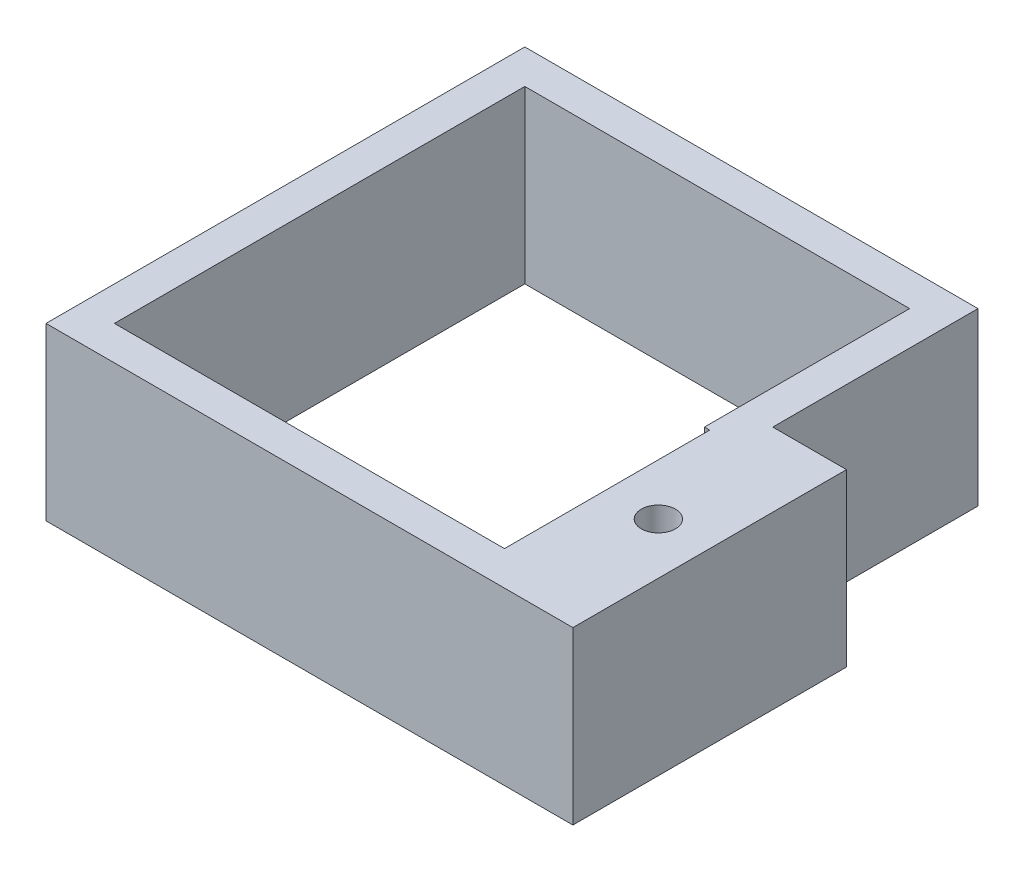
ISO-10303-21;
HEADER;
FILE_DESCRIPTION(('STEP AP214'),'2;1');
FILE_NAME('part.step','',(''),(''),'','','');
FILE_SCHEMA(('AUTOMOTIVE_DESIGN { 1 0 10303 214 1 1 1 1 }'));
ENDSEC;
DATA;
#1=APPLICATION_CONTEXT('core data for automotive mechanical design processes');
#2=APPLICATION_PROTOCOL_DEFINITION('international standard','automotive_design',2000,#1);
#3=PRODUCT_CONTEXT('',#1,'mechanical');
#4=PRODUCT('Part','Part','',(#3));
#5=PRODUCT_RELATED_PRODUCT_CATEGORY('part','',(#4));
#6=PRODUCT_DEFINITION_FORMATION('','',#4);
#7=PRODUCT_DEFINITION_CONTEXT('part definition',#1,'design');
#8=PRODUCT_DEFINITION('design','',#6,#7);
#9=PRODUCT_DEFINITION_SHAPE('','',#8);
#10=(LENGTH_UNIT() NAMED_UNIT(*) SI_UNIT(.MILLI.,.METRE.));
#11=(NAMED_UNIT(*) PLANE_ANGLE_UNIT() SI_UNIT($,.RADIAN.));
#12=(NAMED_UNIT(*) SI_UNIT($,.STERADIAN.) SOLID_ANGLE_UNIT());
#13=UNCERTAINTY_MEASURE_WITH_UNIT(LENGTH_MEASURE(1.E-05),#10,'distance_accuracy_value','');
#14=(GEOMETRIC_REPRESENTATION_CONTEXT(3) GLOBAL_UNCERTAINTY_ASSIGNED_CONTEXT((#13)) GLOBAL_UNIT_ASSIGNED_CONTEXT((#10,
#11,#12)) REPRESENTATION_CONTEXT('',''));
#15=CARTESIAN_POINT('',(0.,0.,0.));
#16=DIRECTION('',(0.,0.,1.));
#17=DIRECTION('',(1.,0.,0.));
#18=AXIS2_PLACEMENT_3D('',#15,#16,#17);
#19=CARTESIAN_POINT('',(0.,10.,0.));
#20=DIRECTION('',(0.,-1.,0.));
#21=DIRECTION('',(0.,0.,-1.));
#22=AXIS2_PLACEMENT_3D('',#19,#20,#21);
#23=PLANE('',#22);
#24=CARTESIAN_POINT('',(27.81,10.,-8.));
#25=DIRECTION('',(0.,1.,0.));
#26=DIRECTION('',(0.,0.,1.));
#27=AXIS2_PLACEMENT_3D('',#24,#25,#26);
#28=CIRCLE('',#27,1.);
#29=CARTESIAN_POINT('',(27.81,10.,-7.));
#30=VERTEX_POINT('',#29);
#31=EDGE_CURVE('E287',#30,#30,#28,.T.);
#32=ORIENTED_EDGE('',*,*,#31,.F.);
#33=EDGE_LOOP('',(#32));
#34=FACE_BOUND('',#33,.T.);
#35=DIRECTION('',(1.,0.,0.));
#36=VECTOR('',#35,1.);
#37=CARTESIAN_POINT('',(30.81,10.,0.));
#38=LINE('',#37,#36);
#39=CARTESIAN_POINT('',(0.,10.,0.));
#40=VERTEX_POINT('',#39);
#41=CARTESIAN_POINT('',(30.81,10.,0.));
#42=VERTEX_POINT('',#41);
#43=EDGE_CURVE('E175',#40,#42,#38,.T.);
#44=ORIENTED_EDGE('',*,*,#43,.T.);
#45=DIRECTION('',(0.,0.,-1.));
#46=VECTOR('',#45,1.);
#47=CARTESIAN_POINT('',(30.81,10.,-16.));
#48=LINE('',#47,#46);
#49=CARTESIAN_POINT('',(30.81,10.,-16.));
#50=VERTEX_POINT('',#49);
#51=EDGE_CURVE('E178',#42,#50,#48,.T.);
#52=ORIENTED_EDGE('',*,*,#51,.T.);
#53=DIRECTION('',(-1.,0.,0.));
#54=VECTOR('',#53,1.);
#55=CARTESIAN_POINT('',(26.5,10.,-16.));
#56=LINE('',#55,#54);
#57=CARTESIAN_POINT('',(26.5,10.,-16.));
#58=VERTEX_POINT('',#57);
#59=EDGE_CURVE('E181',#50,#58,#56,.T.);
#60=ORIENTED_EDGE('',*,*,#59,.T.);
#61=DIRECTION('',(0.,0.,-1.));
#62=VECTOR('',#61,1.);
#63=CARTESIAN_POINT('',(26.5,10.,-28.));
#64=LINE('',#63,#62);
#65=CARTESIAN_POINT('',(26.5,10.,-28.));
#66=VERTEX_POINT('',#65);
#67=EDGE_CURVE('E183',#58,#66,#64,.T.);
#68=ORIENTED_EDGE('',*,*,#67,.T.);
#69=DIRECTION('',(-1.,0.,0.));
#70=VECTOR('',#69,1.);
#71=CARTESIAN_POINT('',(0.,10.,-28.));
#72=LINE('',#71,#70);
#73=CARTESIAN_POINT('',(0.,10.,-28.));
#74=VERTEX_POINT('',#73);
#75=EDGE_CURVE('E185',#66,#74,#72,.T.);
#76=ORIENTED_EDGE('',*,*,#75,.T.);
#77=DIRECTION('',(0.,0.,1.));
#78=VECTOR('',#77,1.);
#79=CARTESIAN_POINT('',(0.,10.,0.));
#80=LINE('',#79,#78);
#81=EDGE_CURVE('E187',#74,#40,#80,.T.);
#82=ORIENTED_EDGE('',*,*,#81,.T.);
#83=EDGE_LOOP('',(#44,#52,#60,#68,#76,#82));
#84=FACE_BOUND('',#83,.T.);
#85=DIRECTION('',(0.,0.,-1.));
#86=VECTOR('',#85,1.);
#87=CARTESIAN_POINT('',(24.81,10.,-2.));
#88=LINE('',#87,#86);
#89=CARTESIAN_POINT('',(24.81,10.,-2.));
#90=VERTEX_POINT('',#89);
#91=CARTESIAN_POINT('',(24.81,10.,-14.));
#92=VERTEX_POINT('',#91);
#93=EDGE_CURVE('E120',#90,#92,#88,.T.);
#94=ORIENTED_EDGE('',*,*,#93,.F.);
#95=DIRECTION('',(1.,0.,0.));
#96=VECTOR('',#95,1.);
#97=CARTESIAN_POINT('',(2.00000000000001,10.,-1.99999999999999));
#98=LINE('',#97,#96);
#99=CARTESIAN_POINT('',(2.00000000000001,10.,-1.99999999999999));
#100=VERTEX_POINT('',#99);
#101=EDGE_CURVE('E151',#100,#90,#98,.T.);
#102=ORIENTED_EDGE('',*,*,#101,.F.);
#103=DIRECTION('',(0.,0.,1.));
#104=VECTOR('',#103,1.);
#105=CARTESIAN_POINT('',(2.,10.,-26.));
#106=LINE('',#105,#104);
#107=CARTESIAN_POINT('',(2.,10.,-26.));
#108=VERTEX_POINT('',#107);
#109=EDGE_CURVE('E149',#108,#100,#106,.T.);
#110=ORIENTED_EDGE('',*,*,#109,.F.);
#111=DIRECTION('',(-1.,0.,0.));
#112=VECTOR('',#111,1.);
#113=CARTESIAN_POINT('',(24.5,10.,-26.));
#114=LINE('',#113,#112);
#115=CARTESIAN_POINT('',(24.5,10.,-26.));
#116=VERTEX_POINT('',#115);
#117=EDGE_CURVE('E144',#116,#108,#114,.T.);
#118=ORIENTED_EDGE('',*,*,#117,.F.);
#119=DIRECTION('',(0.,0.,-1.));
#120=VECTOR('',#119,1.);
#121=CARTESIAN_POINT('',(24.5,10.,-14.));
#122=LINE('',#121,#120);
#123=CARTESIAN_POINT('',(24.5,10.,-14.));
#124=VERTEX_POINT('',#123);
#125=EDGE_CURVE('E142',#124,#116,#122,.T.);
#126=ORIENTED_EDGE('',*,*,#125,.F.);
#127=DIRECTION('',(-1.,0.,0.));
#128=VECTOR('',#127,1.);
#129=CARTESIAN_POINT('',(24.81,10.,-14.));
#130=LINE('',#129,#128);
#131=EDGE_CURVE('E128',#92,#124,#130,.T.);
#132=ORIENTED_EDGE('',*,*,#131,.F.);
#133=EDGE_LOOP('',(#94,#102,#110,#118,#126,#132));
#134=FACE_BOUND('',#133,.T.);
#135=ADVANCED_FACE('F33',(#34,#84,#134),#23,.F.);
#136=CARTESIAN_POINT('',(0.,0.,0.));
#137=DIRECTION('',(0.,-1.,0.));
#138=DIRECTION('',(0.,0.,-1.));
#139=AXIS2_PLACEMENT_3D('',#136,#137,#138);
#140=PLANE('',#139);
#141=CARTESIAN_POINT('',(27.81,0.,-8.));
#142=DIRECTION('',(0.,1.,0.));
#143=DIRECTION('',(0.,0.,1.));
#144=AXIS2_PLACEMENT_3D('',#141,#142,#143);
#145=CIRCLE('',#144,1.);
#146=CARTESIAN_POINT('',(27.81,0.,-7.));
#147=VERTEX_POINT('',#146);
#148=EDGE_CURVE('E155',#147,#147,#145,.T.);
#149=ORIENTED_EDGE('',*,*,#148,.T.);
#150=EDGE_LOOP('',(#149));
#151=FACE_BOUND('',#150,.T.);
#152=DIRECTION('',(1.,0.,0.));
#153=VECTOR('',#152,1.);
#154=CARTESIAN_POINT('',(30.81,0.,0.));
#155=LINE('',#154,#153);
#156=CARTESIAN_POINT('',(0.,0.,0.));
#157=VERTEX_POINT('',#156);
#158=CARTESIAN_POINT('',(30.81,0.,0.));
#159=VERTEX_POINT('',#158);
#160=EDGE_CURVE('E137',#157,#159,#155,.T.);
#161=ORIENTED_EDGE('',*,*,#160,.F.);
#162=DIRECTION('',(0.,0.,1.));
#163=VECTOR('',#162,1.);
#164=CARTESIAN_POINT('',(0.,0.,0.));
#165=LINE('',#164,#163);
#166=CARTESIAN_POINT('',(0.,0.,-28.));
#167=VERTEX_POINT('',#166);
#168=EDGE_CURVE('E179',#167,#157,#165,.T.);
#169=ORIENTED_EDGE('',*,*,#168,.F.);
#170=DIRECTION('',(-1.,0.,0.));
#171=VECTOR('',#170,1.);
#172=CARTESIAN_POINT('',(0.,0.,-28.));
#173=LINE('',#172,#171);
#174=CARTESIAN_POINT('',(26.5,0.,-28.));
#175=VERTEX_POINT('',#174);
#176=EDGE_CURVE('E198',#175,#167,#173,.T.);
#177=ORIENTED_EDGE('',*,*,#176,.F.);
#178=DIRECTION('',(0.,0.,-1.));
#179=VECTOR('',#178,1.);
#180=CARTESIAN_POINT('',(26.5,0.,-28.));
#181=LINE('',#180,#179);
#182=CARTESIAN_POINT('',(26.5,0.,-16.));
#183=VERTEX_POINT('',#182);
#184=EDGE_CURVE('E196',#183,#175,#181,.T.);
#185=ORIENTED_EDGE('',*,*,#184,.F.);
#186=DIRECTION('',(-1.,0.,0.));
#187=VECTOR('',#186,1.);
#188=CARTESIAN_POINT('',(26.5,0.,-16.));
#189=LINE('',#188,#187);
#190=CARTESIAN_POINT('',(30.81,0.,-16.));
#191=VERTEX_POINT('',#190);
#192=EDGE_CURVE('E194',#191,#183,#189,.T.);
#193=ORIENTED_EDGE('',*,*,#192,.F.);
#194=DIRECTION('',(0.,0.,-1.));
#195=VECTOR('',#194,1.);
#196=CARTESIAN_POINT('',(30.81,0.,-16.));
#197=LINE('',#196,#195);
#198=EDGE_CURVE('E192',#159,#191,#197,.T.);
#199=ORIENTED_EDGE('',*,*,#198,.F.);
#200=EDGE_LOOP('',(#161,#169,#177,#185,#193,#199));
#201=FACE_BOUND('',#200,.T.);
#202=DIRECTION('',(1.,0.,0.));
#203=VECTOR('',#202,1.);
#204=CARTESIAN_POINT('',(2.00000000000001,0.,-1.99999999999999));
#205=LINE('',#204,#203);
#206=CARTESIAN_POINT('',(2.00000000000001,0.,-1.99999999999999));
#207=VERTEX_POINT('',#206);
#208=CARTESIAN_POINT('',(24.81,0.,-2.));
#209=VERTEX_POINT('',#208);
#210=EDGE_CURVE('E129',#207,#209,#205,.T.);
#211=ORIENTED_EDGE('',*,*,#210,.T.);
#212=DIRECTION('',(0.,0.,-1.));
#213=VECTOR('',#212,1.);
#214=CARTESIAN_POINT('',(24.81,0.,-6.73909948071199));
#215=LINE('',#214,#213);
#216=CARTESIAN_POINT('',(24.81,0.,-14.));
#217=VERTEX_POINT('',#216);
#218=EDGE_CURVE('E153',#209,#217,#215,.T.);
#219=ORIENTED_EDGE('',*,*,#218,.T.);
#220=DIRECTION('',(-1.,0.,0.));
#221=VECTOR('',#220,1.);
#222=CARTESIAN_POINT('',(24.81,0.,-14.));
#223=LINE('',#222,#221);
#224=CARTESIAN_POINT('',(24.5,0.,-14.));
#225=VERTEX_POINT('',#224);
#226=EDGE_CURVE('E135',#217,#225,#223,.T.);
#227=ORIENTED_EDGE('',*,*,#226,.T.);
#228=DIRECTION('',(0.,0.,-1.));
#229=VECTOR('',#228,1.);
#230=CARTESIAN_POINT('',(24.5,0.,-14.));
#231=LINE('',#230,#229);
#232=CARTESIAN_POINT('',(24.5,0.,-26.));
#233=VERTEX_POINT('',#232);
#234=EDGE_CURVE('E157',#225,#233,#231,.T.);
#235=ORIENTED_EDGE('',*,*,#234,.T.);
#236=DIRECTION('',(-1.,0.,0.));
#237=VECTOR('',#236,1.);
#238=CARTESIAN_POINT('',(24.5,0.,-26.));
#239=LINE('',#238,#237);
#240=CARTESIAN_POINT('',(2.,0.,-26.));
#241=VERTEX_POINT('',#240);
#242=EDGE_CURVE('E160',#233,#241,#239,.T.);
#243=ORIENTED_EDGE('',*,*,#242,.T.);
#244=DIRECTION('',(0.,0.,1.));
#245=VECTOR('',#244,1.);
#246=CARTESIAN_POINT('',(2.,0.,-26.));
#247=LINE('',#246,#245);
#248=EDGE_CURVE('E163',#241,#207,#247,.T.);
#249=ORIENTED_EDGE('',*,*,#248,.T.);
#250=EDGE_LOOP('',(#211,#219,#227,#235,#243,#249));
#251=FACE_BOUND('',#250,.T.);
#252=ADVANCED_FACE('F222',(#151,#201,#251),#140,.T.);
#253=CARTESIAN_POINT('',(30.81,10.,0.));
#254=DIRECTION('',(0.,0.,-1.));
#255=DIRECTION('',(-1.,0.,0.));
#256=AXIS2_PLACEMENT_3D('',#253,#254,#255);
#257=PLANE('',#256);
#258=ORIENTED_EDGE('',*,*,#160,.T.);
#259=DIRECTION('',(0.,-1.,0.));
#260=VECTOR('',#259,1.);
#261=CARTESIAN_POINT('',(30.81,10.,0.));
#262=LINE('',#261,#260);
#263=EDGE_CURVE('E11',#42,#159,#262,.T.);
#264=ORIENTED_EDGE('',*,*,#263,.F.);
#265=ORIENTED_EDGE('',*,*,#43,.F.);
#266=DIRECTION('',(0.,-1.,0.));
#267=VECTOR('',#266,1.);
#268=CARTESIAN_POINT('',(0.,10.,0.));
#269=LINE('',#268,#267);
#270=EDGE_CURVE('E189',#40,#157,#269,.T.);
#271=ORIENTED_EDGE('',*,*,#270,.T.);
#272=EDGE_LOOP('',(#258,#264,#265,#271));
#273=FACE_BOUND('',#272,.T.);
#274=ADVANCED_FACE('F35',(#273),#257,.F.);
#275=CARTESIAN_POINT('',(30.81,10.,-16.));
#276=DIRECTION('',(-1.,0.,0.));
#277=DIRECTION('',(0.,0.,1.));
#278=AXIS2_PLACEMENT_3D('',#275,#276,#277);
#279=PLANE('',#278);
#280=ORIENTED_EDGE('',*,*,#198,.T.);
#281=DIRECTION('',(0.,-1.,0.));
#282=VECTOR('',#281,1.);
#283=CARTESIAN_POINT('',(30.81,10.,-16.));
#284=LINE('',#283,#282);
#285=EDGE_CURVE('E41',#50,#191,#284,.T.);
#286=ORIENTED_EDGE('',*,*,#285,.F.);
#287=ORIENTED_EDGE('',*,*,#51,.F.);
#288=ORIENTED_EDGE('',*,*,#263,.T.);
#289=EDGE_LOOP('',(#280,#286,#287,#288));
#290=FACE_BOUND('',#289,.T.);
#291=ADVANCED_FACE('F239',(#290),#279,.F.);
#292=CARTESIAN_POINT('',(26.5,10.,-16.));
#293=DIRECTION('',(0.,0.,1.));
#294=DIRECTION('',(1.,0.,0.));
#295=AXIS2_PLACEMENT_3D('',#292,#293,#294);
#296=PLANE('',#295);
#297=ORIENTED_EDGE('',*,*,#192,.T.);
#298=DIRECTION('',(0.,-1.,0.));
#299=VECTOR('',#298,1.);
#300=CARTESIAN_POINT('',(26.5,10.,-16.));
#301=LINE('',#300,#299);
#302=EDGE_CURVE('E209',#58,#183,#301,.T.);
#303=ORIENTED_EDGE('',*,*,#302,.F.);
#304=ORIENTED_EDGE('',*,*,#59,.F.);
#305=ORIENTED_EDGE('',*,*,#285,.T.);
#306=EDGE_LOOP('',(#297,#303,#304,#305));
#307=FACE_BOUND('',#306,.T.);
#308=ADVANCED_FACE('F216',(#307),#296,.F.);
#309=CARTESIAN_POINT('',(26.5,10.,-28.));
#310=DIRECTION('',(-1.,0.,0.));
#311=DIRECTION('',(0.,0.,1.));
#312=AXIS2_PLACEMENT_3D('',#309,#310,#311);
#313=PLANE('',#312);
#314=ORIENTED_EDGE('',*,*,#184,.T.);
#315=DIRECTION('',(0.,-1.,0.));
#316=VECTOR('',#315,1.);
#317=CARTESIAN_POINT('',(26.5,10.,-28.));
#318=LINE('',#317,#316);
#319=EDGE_CURVE('E206',#66,#175,#318,.T.);
#320=ORIENTED_EDGE('',*,*,#319,.F.);
#321=ORIENTED_EDGE('',*,*,#67,.F.);
#322=ORIENTED_EDGE('',*,*,#302,.T.);
#323=EDGE_LOOP('',(#314,#320,#321,#322));
#324=FACE_BOUND('',#323,.T.);
#325=ADVANCED_FACE('F228',(#324),#313,.F.);
#326=CARTESIAN_POINT('',(0.,10.,-28.));
#327=DIRECTION('',(0.,0.,1.));
#328=DIRECTION('',(1.,0.,0.));
#329=AXIS2_PLACEMENT_3D('',#326,#327,#328);
#330=PLANE('',#329);
#331=ORIENTED_EDGE('',*,*,#176,.T.);
#332=DIRECTION('',(0.,-1.,0.));
#333=VECTOR('',#332,1.);
#334=CARTESIAN_POINT('',(0.,10.,-28.));
#335=LINE('',#334,#333);
#336=EDGE_CURVE('E203',#74,#167,#335,.T.);
#337=ORIENTED_EDGE('',*,*,#336,.F.);
#338=ORIENTED_EDGE('',*,*,#75,.F.);
#339=ORIENTED_EDGE('',*,*,#319,.T.);
#340=EDGE_LOOP('',(#331,#337,#338,#339));
#341=FACE_BOUND('',#340,.T.);
#342=ADVANCED_FACE('F232',(#341),#330,.F.);
#343=CARTESIAN_POINT('',(0.,10.,0.));
#344=DIRECTION('',(1.,0.,0.));
#345=DIRECTION('',(0.,0.,-1.));
#346=AXIS2_PLACEMENT_3D('',#343,#344,#345);
#347=PLANE('',#346);
#348=ORIENTED_EDGE('',*,*,#168,.T.);
#349=ORIENTED_EDGE('',*,*,#270,.F.);
#350=ORIENTED_EDGE('',*,*,#81,.F.);
#351=ORIENTED_EDGE('',*,*,#336,.T.);
#352=EDGE_LOOP('',(#348,#349,#350,#351));
#353=FACE_BOUND('',#352,.T.);
#354=ADVANCED_FACE('F242',(#353),#347,.F.);
#355=CARTESIAN_POINT('',(24.81,10.,-6.73909948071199));
#356=DIRECTION('',(-1.,0.,0.));
#357=DIRECTION('',(0.,0.,1.));
#358=AXIS2_PLACEMENT_3D('',#355,#356,#357);
#359=PLANE('',#358);
#360=ORIENTED_EDGE('',*,*,#218,.F.);
#361=DIRECTION('',(0.,-1.,0.));
#362=VECTOR('',#361,1.);
#363=CARTESIAN_POINT('',(24.81,10.,-2.));
#364=LINE('',#363,#362);
#365=EDGE_CURVE('E53',#90,#209,#364,.T.);
#366=ORIENTED_EDGE('',*,*,#365,.F.);
#367=ORIENTED_EDGE('',*,*,#93,.T.);
#368=DIRECTION('',(0.,-1.,0.));
#369=VECTOR('',#368,1.);
#370=CARTESIAN_POINT('',(24.81,10.,-14.));
#371=LINE('',#370,#369);
#372=EDGE_CURVE('E123',#92,#217,#371,.T.);
#373=ORIENTED_EDGE('',*,*,#372,.T.);
#374=EDGE_LOOP('',(#360,#366,#367,#373));
#375=FACE_BOUND('',#374,.T.);
#376=ADVANCED_FACE('F122',(#375),#359,.T.);
#377=CARTESIAN_POINT('',(24.81,10.,-14.));
#378=DIRECTION('',(0.,0.,1.));
#379=DIRECTION('',(1.,0.,0.));
#380=AXIS2_PLACEMENT_3D('',#377,#378,#379);
#381=PLANE('',#380);
#382=ORIENTED_EDGE('',*,*,#226,.F.);
#383=ORIENTED_EDGE('',*,*,#372,.F.);
#384=ORIENTED_EDGE('',*,*,#131,.T.);
#385=DIRECTION('',(0.,-1.,0.));
#386=VECTOR('',#385,1.);
#387=CARTESIAN_POINT('',(24.5,10.,-14.));
#388=LINE('',#387,#386);
#389=EDGE_CURVE('E138',#124,#225,#388,.T.);
#390=ORIENTED_EDGE('',*,*,#389,.T.);
#391=EDGE_LOOP('',(#382,#383,#384,#390));
#392=FACE_BOUND('',#391,.T.);
#393=ADVANCED_FACE('F132',(#392),#381,.T.);
#394=CARTESIAN_POINT('',(24.5,10.,-14.));
#395=DIRECTION('',(-1.,0.,0.));
#396=DIRECTION('',(0.,0.,1.));
#397=AXIS2_PLACEMENT_3D('',#394,#395,#396);
#398=PLANE('',#397);
#399=ORIENTED_EDGE('',*,*,#234,.F.);
#400=ORIENTED_EDGE('',*,*,#389,.F.);
#401=ORIENTED_EDGE('',*,*,#125,.T.);
#402=DIRECTION('',(0.,-1.,0.));
#403=VECTOR('',#402,1.);
#404=CARTESIAN_POINT('',(24.5,10.,-26.));
#405=LINE('',#404,#403);
#406=EDGE_CURVE('E172',#116,#233,#405,.T.);
#407=ORIENTED_EDGE('',*,*,#406,.T.);
#408=EDGE_LOOP('',(#399,#400,#401,#407));
#409=FACE_BOUND('',#408,.T.);
#410=ADVANCED_FACE('F263',(#409),#398,.T.);
#411=CARTESIAN_POINT('',(24.5,10.,-26.));
#412=DIRECTION('',(0.,0.,1.));
#413=DIRECTION('',(1.,0.,0.));
#414=AXIS2_PLACEMENT_3D('',#411,#412,#413);
#415=PLANE('',#414);
#416=ORIENTED_EDGE('',*,*,#242,.F.);
#417=ORIENTED_EDGE('',*,*,#406,.F.);
#418=ORIENTED_EDGE('',*,*,#117,.T.);
#419=DIRECTION('',(0.,-1.,0.));
#420=VECTOR('',#419,1.);
#421=CARTESIAN_POINT('',(2.,10.,-26.));
#422=LINE('',#421,#420);
#423=EDGE_CURVE('E170',#108,#241,#422,.T.);
#424=ORIENTED_EDGE('',*,*,#423,.T.);
#425=EDGE_LOOP('',(#416,#417,#418,#424));
#426=FACE_BOUND('',#425,.T.);
#427=ADVANCED_FACE('F266',(#426),#415,.T.);
#428=CARTESIAN_POINT('',(2.,10.,-26.));
#429=DIRECTION('',(1.,0.,0.));
#430=DIRECTION('',(0.,0.,-1.));
#431=AXIS2_PLACEMENT_3D('',#428,#429,#430);
#432=PLANE('',#431);
#433=ORIENTED_EDGE('',*,*,#248,.F.);
#434=ORIENTED_EDGE('',*,*,#423,.F.);
#435=ORIENTED_EDGE('',*,*,#109,.T.);
#436=DIRECTION('',(0.,-1.,0.));
#437=VECTOR('',#436,1.);
#438=CARTESIAN_POINT('',(2.00000000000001,10.,-1.99999999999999));
#439=LINE('',#438,#437);
#440=EDGE_CURVE('E48',#100,#207,#439,.T.);
#441=ORIENTED_EDGE('',*,*,#440,.T.);
#442=EDGE_LOOP('',(#433,#434,#435,#441));
#443=FACE_BOUND('',#442,.T.);
#444=ADVANCED_FACE('F270',(#443),#432,.T.);
#445=CARTESIAN_POINT('',(2.00000000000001,10.,-1.99999999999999));
#446=DIRECTION('',(0.,0.,-1.));
#447=DIRECTION('',(-1.,0.,0.));
#448=AXIS2_PLACEMENT_3D('',#445,#446,#447);
#449=PLANE('',#448);
#450=ORIENTED_EDGE('',*,*,#210,.F.);
#451=ORIENTED_EDGE('',*,*,#440,.F.);
#452=ORIENTED_EDGE('',*,*,#101,.T.);
#453=ORIENTED_EDGE('',*,*,#365,.T.);
#454=EDGE_LOOP('',(#450,#451,#452,#453));
#455=FACE_BOUND('',#454,.T.);
#456=ADVANCED_FACE('F274',(#455),#449,.T.);
#457=CARTESIAN_POINT('',(27.81,0.,-8.));
#458=DIRECTION('',(0.,1.,0.));
#459=DIRECTION('',(0.,0.,1.));
#460=AXIS2_PLACEMENT_3D('',#457,#458,#459);
#461=CYLINDRICAL_SURFACE('',#460,1.);
#462=ORIENTED_EDGE('',*,*,#148,.F.);
#463=EDGE_LOOP('',(#462));
#464=FACE_BOUND('',#463,.T.);
#465=ORIENTED_EDGE('',*,*,#31,.T.);
#466=EDGE_LOOP('',(#465));
#467=FACE_BOUND('',#466,.T.);
#468=ADVANCED_FACE('F278',(#464,#467),#461,.F.);
#469=CLOSED_SHELL('',(#135,#252,#274,#291,#308,#325,#342,#354,#376,#393,#410,#427,#444,#456,#468));
#470=MANIFOLD_SOLID_BREP('B2',#469);
#471=ADVANCED_BREP_SHAPE_REPRESENTATION('',(#18,#470),#14);
#472=SHAPE_DEFINITION_REPRESENTATION(#9,#471);
ENDSEC;
END-ISO-10303-21;
